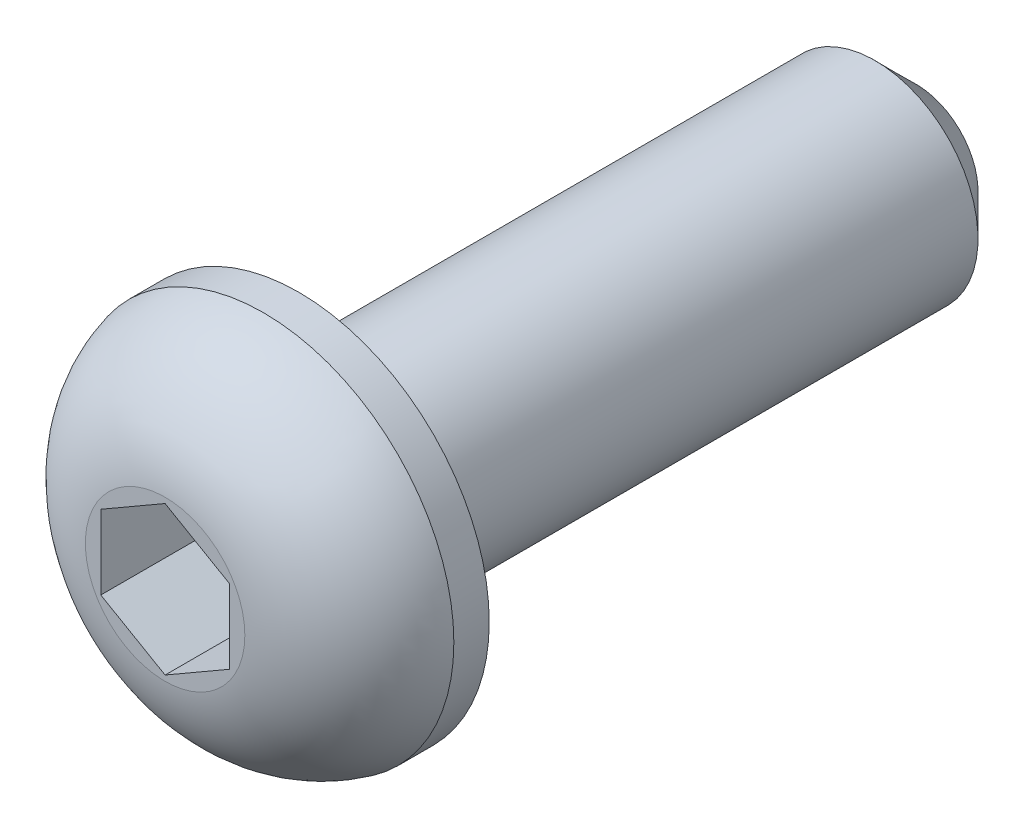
ISO-10303-21;
HEADER;
FILE_DESCRIPTION(('STEP AP214'),'2;1');
FILE_NAME('part.step','',(''),(''),'','','');
FILE_SCHEMA(('AUTOMOTIVE_DESIGN { 1 0 10303 214 1 1 1 1 }'));
ENDSEC;
DATA;
#1=APPLICATION_CONTEXT('core data for automotive mechanical design processes');
#2=APPLICATION_PROTOCOL_DEFINITION('international standard','automotive_design',2000,#1);
#3=PRODUCT_CONTEXT('',#1,'mechanical');
#4=PRODUCT('Part','Part','',(#3));
#5=PRODUCT_RELATED_PRODUCT_CATEGORY('part','',(#4));
#6=PRODUCT_DEFINITION_FORMATION('','',#4);
#7=PRODUCT_DEFINITION_CONTEXT('part definition',#1,'design');
#8=PRODUCT_DEFINITION('design','',#6,#7);
#9=PRODUCT_DEFINITION_SHAPE('','',#8);
#10=(LENGTH_UNIT() NAMED_UNIT(*) SI_UNIT(.MILLI.,.METRE.));
#11=(NAMED_UNIT(*) PLANE_ANGLE_UNIT() SI_UNIT($,.RADIAN.));
#12=(NAMED_UNIT(*) SI_UNIT($,.STERADIAN.) SOLID_ANGLE_UNIT());
#13=UNCERTAINTY_MEASURE_WITH_UNIT(LENGTH_MEASURE(1.E-05),#10,'distance_accuracy_value','');
#14=(GEOMETRIC_REPRESENTATION_CONTEXT(3) GLOBAL_UNCERTAINTY_ASSIGNED_CONTEXT((#13)) GLOBAL_UNIT_ASSIGNED_CONTEXT((#10,
#11,#12)) REPRESENTATION_CONTEXT('',''));
#15=CARTESIAN_POINT('',(0.,0.,0.));
#16=DIRECTION('',(0.,0.,1.));
#17=DIRECTION('',(1.,0.,0.));
#18=AXIS2_PLACEMENT_3D('',#15,#16,#17);
#19=CARTESIAN_POINT('',(0.,0.,0.116164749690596));
#20=DIRECTION('',(0.,0.,1.));
#21=DIRECTION('',(1.,0.,0.));
#22=AXIS2_PLACEMENT_3D('',#19,#20,#21);
#23=DEGENERATE_TOROIDAL_SURFACE('',#22,1.26616474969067,2.49999999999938,.T.);
#24=CARTESIAN_POINT('',(0.,0.,2.6));
#25=DIRECTION('',(0.,0.,1.));
#26=DIRECTION('',(1.,0.,0.));
#27=AXIS2_PLACEMENT_3D('',#24,#25,#26);
#28=CIRCLE('',#27,1.54999999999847);
#29=CARTESIAN_POINT('',(1.54999999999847,0.,2.6));
#30=VERTEX_POINT('',#29);
#31=EDGE_CURVE('E118',#30,#30,#28,.T.);
#32=ORIENTED_EDGE('',*,*,#31,.F.);
#33=EDGE_LOOP('',(#32));
#34=FACE_BOUND('',#33,.T.);
#35=CARTESIAN_POINT('',(0.,0.,0.687519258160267));
#36=DIRECTION('',(0.,0.,-1.));
#37=DIRECTION('',(-1.,0.,0.));
#38=AXIS2_PLACEMENT_3D('',#35,#36,#37);
#39=CIRCLE('',#38,3.7);
#40=CARTESIAN_POINT('',(-3.7,0.,0.687519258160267));
#41=VERTEX_POINT('',#40);
#42=EDGE_CURVE('E188',#41,#41,#39,.T.);
#43=ORIENTED_EDGE('',*,*,#42,.F.);
#44=EDGE_LOOP('',(#43));
#45=FACE_BOUND('',#44,.T.);
#46=ADVANCED_FACE('F14',(#34,#45),#23,.T.);
#47=CARTESIAN_POINT('',(0.,1.54999999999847,2.6));
#48=DIRECTION('',(0.,0.,-1.));
#49=DIRECTION('',(-1.,0.,0.));
#50=AXIS2_PLACEMENT_3D('',#47,#48,#49);
#51=PLANE('',#50);
#52=DIRECTION('',(-0.866025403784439,-0.5,0.));
#53=VECTOR('',#52,1.);
#54=CARTESIAN_POINT('',(0.,1.44337567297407,2.6));
#55=LINE('',#54,#53);
#56=CARTESIAN_POINT('',(0.,1.44337567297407,2.6));
#57=VERTEX_POINT('',#56);
#58=CARTESIAN_POINT('',(-1.25,0.721687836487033,2.6));
#59=VERTEX_POINT('',#58);
#60=EDGE_CURVE('E104',#57,#59,#55,.T.);
#61=ORIENTED_EDGE('',*,*,#60,.F.);
#62=DIRECTION('',(-0.866025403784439,0.5,0.));
#63=VECTOR('',#62,1.);
#64=CARTESIAN_POINT('',(1.25,0.721687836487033,2.6));
#65=LINE('',#64,#63);
#66=CARTESIAN_POINT('',(1.25,0.721687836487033,2.6));
#67=VERTEX_POINT('',#66);
#68=EDGE_CURVE('E30',#67,#57,#65,.T.);
#69=ORIENTED_EDGE('',*,*,#68,.F.);
#70=DIRECTION('',(0.,1.,0.));
#71=VECTOR('',#70,1.);
#72=CARTESIAN_POINT('',(1.25,-0.721687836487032,2.6));
#73=LINE('',#72,#71);
#74=CARTESIAN_POINT('',(1.25,-0.721687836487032,2.6));
#75=VERTEX_POINT('',#74);
#76=EDGE_CURVE('E114',#75,#67,#73,.T.);
#77=ORIENTED_EDGE('',*,*,#76,.F.);
#78=DIRECTION('',(0.866025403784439,0.5,0.));
#79=VECTOR('',#78,1.);
#80=CARTESIAN_POINT('',(0.,-1.44337567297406,2.6));
#81=LINE('',#80,#79);
#82=CARTESIAN_POINT('',(0.,-1.44337567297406,2.6));
#83=VERTEX_POINT('',#82);
#84=EDGE_CURVE('E112',#83,#75,#81,.T.);
#85=ORIENTED_EDGE('',*,*,#84,.F.);
#86=DIRECTION('',(0.866025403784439,-0.5,0.));
#87=VECTOR('',#86,1.);
#88=CARTESIAN_POINT('',(-1.25,-0.721687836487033,2.6));
#89=LINE('',#88,#87);
#90=CARTESIAN_POINT('',(-1.25,-0.721687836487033,2.6));
#91=VERTEX_POINT('',#90);
#92=EDGE_CURVE('E78',#91,#83,#89,.T.);
#93=ORIENTED_EDGE('',*,*,#92,.F.);
#94=DIRECTION('',(0.,-1.,0.));
#95=VECTOR('',#94,1.);
#96=CARTESIAN_POINT('',(-1.25,0.721687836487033,2.6));
#97=LINE('',#96,#95);
#98=EDGE_CURVE('E108',#59,#91,#97,.T.);
#99=ORIENTED_EDGE('',*,*,#98,.F.);
#100=EDGE_LOOP('',(#61,#69,#77,#85,#93,#99));
#101=FACE_BOUND('',#100,.T.);
#102=ORIENTED_EDGE('',*,*,#31,.T.);
#103=EDGE_LOOP('',(#102));
#104=FACE_BOUND('',#103,.T.);
#105=ADVANCED_FACE('F146',(#101,#104),#51,.F.);
#106=CARTESIAN_POINT('',(1.25,0.721687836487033,0.600000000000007));
#107=DIRECTION('',(0.5,0.866025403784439,0.));
#108=DIRECTION('',(-0.866025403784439,0.5,0.));
#109=AXIS2_PLACEMENT_3D('',#106,#107,#108);
#110=PLANE('',#109);
#111=ORIENTED_EDGE('',*,*,#68,.T.);
#112=DIRECTION('',(0.,0.,1.));
#113=VECTOR('',#112,1.);
#114=CARTESIAN_POINT('',(0.,1.44337567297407,0.600000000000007));
#115=LINE('',#114,#113);
#116=CARTESIAN_POINT('',(0.,1.44337567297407,0.600000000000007));
#117=VERTEX_POINT('',#116);
#118=EDGE_CURVE('E60',#117,#57,#115,.T.);
#119=ORIENTED_EDGE('',*,*,#118,.F.);
#120=DIRECTION('',(-0.866025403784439,0.5,0.));
#121=VECTOR('',#120,1.);
#122=CARTESIAN_POINT('',(1.25,0.721687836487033,0.600000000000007));
#123=LINE('',#122,#121);
#124=CARTESIAN_POINT('',(1.25,0.721687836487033,0.600000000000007));
#125=VERTEX_POINT('',#124);
#126=EDGE_CURVE('E116',#125,#117,#123,.T.);
#127=ORIENTED_EDGE('',*,*,#126,.F.);
#128=DIRECTION('',(0.,0.,1.));
#129=VECTOR('',#128,1.);
#130=CARTESIAN_POINT('',(1.25,0.721687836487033,0.600000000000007));
#131=LINE('',#130,#129);
#132=EDGE_CURVE('E38',#125,#67,#131,.T.);
#133=ORIENTED_EDGE('',*,*,#132,.T.);
#134=EDGE_LOOP('',(#111,#119,#127,#133));
#135=FACE_BOUND('',#134,.T.);
#136=ADVANCED_FACE('F151',(#135),#110,.F.);
#137=CARTESIAN_POINT('',(1.25,-0.721687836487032,0.600000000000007));
#138=DIRECTION('',(1.,0.,0.));
#139=DIRECTION('',(0.,0.,-1.));
#140=AXIS2_PLACEMENT_3D('',#137,#138,#139);
#141=PLANE('',#140);
#142=ORIENTED_EDGE('',*,*,#76,.T.);
#143=ORIENTED_EDGE('',*,*,#132,.F.);
#144=DIRECTION('',(0.,1.,0.));
#145=VECTOR('',#144,1.);
#146=CARTESIAN_POINT('',(1.25,-0.721687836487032,0.600000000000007));
#147=LINE('',#146,#145);
#148=CARTESIAN_POINT('',(1.25,-0.721687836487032,0.600000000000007));
#149=VERTEX_POINT('',#148);
#150=EDGE_CURVE('E90',#149,#125,#147,.T.);
#151=ORIENTED_EDGE('',*,*,#150,.F.);
#152=DIRECTION('',(0.,0.,1.));
#153=VECTOR('',#152,1.);
#154=CARTESIAN_POINT('',(1.25,-0.721687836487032,0.600000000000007));
#155=LINE('',#154,#153);
#156=EDGE_CURVE('E82',#149,#75,#155,.T.);
#157=ORIENTED_EDGE('',*,*,#156,.T.);
#158=EDGE_LOOP('',(#142,#143,#151,#157));
#159=FACE_BOUND('',#158,.T.);
#160=ADVANCED_FACE('F159',(#159),#141,.F.);
#161=CARTESIAN_POINT('',(0.,-1.44337567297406,0.600000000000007));
#162=DIRECTION('',(0.5,-0.866025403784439,0.));
#163=DIRECTION('',(0.866025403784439,0.5,0.));
#164=AXIS2_PLACEMENT_3D('',#161,#162,#163);
#165=PLANE('',#164);
#166=ORIENTED_EDGE('',*,*,#84,.T.);
#167=ORIENTED_EDGE('',*,*,#156,.F.);
#168=DIRECTION('',(0.866025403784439,0.5,0.));
#169=VECTOR('',#168,1.);
#170=CARTESIAN_POINT('',(0.,-1.44337567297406,0.600000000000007));
#171=LINE('',#170,#169);
#172=CARTESIAN_POINT('',(0.,-1.44337567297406,0.600000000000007));
#173=VERTEX_POINT('',#172);
#174=EDGE_CURVE('E86',#173,#149,#171,.T.);
#175=ORIENTED_EDGE('',*,*,#174,.F.);
#176=DIRECTION('',(0.,0.,1.));
#177=VECTOR('',#176,1.);
#178=CARTESIAN_POINT('',(0.,-1.44337567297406,0.600000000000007));
#179=LINE('',#178,#177);
#180=EDGE_CURVE('E71',#173,#83,#179,.T.);
#181=ORIENTED_EDGE('',*,*,#180,.T.);
#182=EDGE_LOOP('',(#166,#167,#175,#181));
#183=FACE_BOUND('',#182,.T.);
#184=ADVANCED_FACE('F87',(#183),#165,.F.);
#185=CARTESIAN_POINT('',(-1.25,-0.721687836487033,0.600000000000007));
#186=DIRECTION('',(-0.5,-0.866025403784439,0.));
#187=DIRECTION('',(0.866025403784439,-0.5,0.));
#188=AXIS2_PLACEMENT_3D('',#185,#186,#187);
#189=PLANE('',#188);
#190=ORIENTED_EDGE('',*,*,#92,.T.);
#191=ORIENTED_EDGE('',*,*,#180,.F.);
#192=DIRECTION('',(0.866025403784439,-0.5,0.));
#193=VECTOR('',#192,1.);
#194=CARTESIAN_POINT('',(-1.25,-0.721687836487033,0.600000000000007));
#195=LINE('',#194,#193);
#196=CARTESIAN_POINT('',(-1.25,-0.721687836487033,0.600000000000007));
#197=VERTEX_POINT('',#196);
#198=EDGE_CURVE('E75',#197,#173,#195,.T.);
#199=ORIENTED_EDGE('',*,*,#198,.F.);
#200=DIRECTION('',(0.,0.,1.));
#201=VECTOR('',#200,1.);
#202=CARTESIAN_POINT('',(-1.25,-0.721687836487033,0.600000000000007));
#203=LINE('',#202,#201);
#204=EDGE_CURVE('E83',#197,#91,#203,.T.);
#205=ORIENTED_EDGE('',*,*,#204,.T.);
#206=EDGE_LOOP('',(#190,#191,#199,#205));
#207=FACE_BOUND('',#206,.T.);
#208=ADVANCED_FACE('F73',(#207),#189,.F.);
#209=CARTESIAN_POINT('',(-1.25,0.721687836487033,0.600000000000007));
#210=DIRECTION('',(-1.,0.,0.));
#211=DIRECTION('',(0.,-1.,0.));
#212=AXIS2_PLACEMENT_3D('',#209,#210,#211);
#213=PLANE('',#212);
#214=ORIENTED_EDGE('',*,*,#98,.T.);
#215=ORIENTED_EDGE('',*,*,#204,.F.);
#216=DIRECTION('',(0.,-1.,0.));
#217=VECTOR('',#216,1.);
#218=CARTESIAN_POINT('',(-1.25,0.721687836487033,0.600000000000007));
#219=LINE('',#218,#217);
#220=CARTESIAN_POINT('',(-1.25,0.721687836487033,0.600000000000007));
#221=VERTEX_POINT('',#220);
#222=EDGE_CURVE('E96',#221,#197,#219,.T.);
#223=ORIENTED_EDGE('',*,*,#222,.F.);
#224=DIRECTION('',(0.,0.,1.));
#225=VECTOR('',#224,1.);
#226=CARTESIAN_POINT('',(-1.25,0.721687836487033,0.600000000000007));
#227=LINE('',#226,#225);
#228=EDGE_CURVE('E121',#221,#59,#227,.T.);
#229=ORIENTED_EDGE('',*,*,#228,.T.);
#230=EDGE_LOOP('',(#214,#215,#223,#229));
#231=FACE_BOUND('',#230,.T.);
#232=ADVANCED_FACE('F163',(#231),#213,.F.);
#233=CARTESIAN_POINT('',(0.,1.44337567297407,0.600000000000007));
#234=DIRECTION('',(-0.5,0.866025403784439,0.));
#235=DIRECTION('',(-0.866025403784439,-0.5,0.));
#236=AXIS2_PLACEMENT_3D('',#233,#234,#235);
#237=PLANE('',#236);
#238=ORIENTED_EDGE('',*,*,#60,.T.);
#239=ORIENTED_EDGE('',*,*,#228,.F.);
#240=DIRECTION('',(-0.866025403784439,-0.5,0.));
#241=VECTOR('',#240,1.);
#242=CARTESIAN_POINT('',(0.,1.44337567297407,0.600000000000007));
#243=LINE('',#242,#241);
#244=EDGE_CURVE('E98',#117,#221,#243,.T.);
#245=ORIENTED_EDGE('',*,*,#244,.F.);
#246=ORIENTED_EDGE('',*,*,#118,.T.);
#247=EDGE_LOOP('',(#238,#239,#245,#246));
#248=FACE_BOUND('',#247,.T.);
#249=ADVANCED_FACE('F160',(#248),#237,.F.);
#250=CARTESIAN_POINT('',(0.,1.44337567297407,0.600000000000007));
#251=DIRECTION('',(0.,0.,1.));
#252=DIRECTION('',(1.,0.,0.));
#253=AXIS2_PLACEMENT_3D('',#250,#251,#252);
#254=PLANE('',#253);
#255=ORIENTED_EDGE('',*,*,#126,.T.);
#256=ORIENTED_EDGE('',*,*,#244,.T.);
#257=ORIENTED_EDGE('',*,*,#222,.T.);
#258=ORIENTED_EDGE('',*,*,#198,.T.);
#259=ORIENTED_EDGE('',*,*,#174,.T.);
#260=ORIENTED_EDGE('',*,*,#150,.T.);
#261=EDGE_LOOP('',(#255,#256,#257,#258,#259,#260));
#262=FACE_BOUND('',#261,.T.);
#263=ADVANCED_FACE('F93',(#262),#254,.T.);
#264=CARTESIAN_POINT('',(0.,0.,-1.4));
#265=DIRECTION('',(0.,0.,1.));
#266=DIRECTION('',(1.,0.,0.));
#267=AXIS2_PLACEMENT_3D('',#264,#265,#266);
#268=CYLINDRICAL_SURFACE('',#267,3.7);
#269=CARTESIAN_POINT('',(0.,0.,0.));
#270=DIRECTION('',(0.,0.,-1.));
#271=DIRECTION('',(-1.,0.,0.));
#272=AXIS2_PLACEMENT_3D('',#269,#270,#271);
#273=CIRCLE('',#272,3.7);
#274=CARTESIAN_POINT('',(-3.7,0.,0.));
#275=VERTEX_POINT('',#274);
#276=EDGE_CURVE('E18',#275,#275,#273,.T.);
#277=ORIENTED_EDGE('',*,*,#276,.F.);
#278=EDGE_LOOP('',(#277));
#279=FACE_BOUND('',#278,.T.);
#280=ORIENTED_EDGE('',*,*,#42,.T.);
#281=EDGE_LOOP('',(#280));
#282=FACE_BOUND('',#281,.T.);
#283=ADVANCED_FACE('F142',(#279,#282),#268,.T.);
#284=CARTESIAN_POINT('',(0.,0.,-12.));
#285=DIRECTION('',(0.,0.,-1.));
#286=DIRECTION('',(-1.,0.,0.));
#287=AXIS2_PLACEMENT_3D('',#284,#285,#286);
#288=PLANE('',#287);
#289=CARTESIAN_POINT('',(0.,0.,-12.));
#290=DIRECTION('',(0.,0.,-1.));
#291=DIRECTION('',(-1.,0.,0.));
#292=AXIS2_PLACEMENT_3D('',#289,#290,#291);
#293=CIRCLE('',#292,1.2);
#294=CARTESIAN_POINT('',(-1.2,0.,-12.));
#295=VERTEX_POINT('',#294);
#296=EDGE_CURVE('E23',#295,#295,#293,.T.);
#297=ORIENTED_EDGE('',*,*,#296,.T.);
#298=EDGE_LOOP('',(#297));
#299=FACE_BOUND('',#298,.T.);
#300=ADVANCED_FACE('F129',(#299),#288,.T.);
#301=CARTESIAN_POINT('',(0.,0.,-12.));
#302=DIRECTION('',(0.,0.,1.));
#303=DIRECTION('',(1.,0.,0.));
#304=AXIS2_PLACEMENT_3D('',#301,#302,#303);
#305=CONICAL_SURFACE('',#304,1.2,0.785398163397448);
#306=CARTESIAN_POINT('',(0.,0.,-11.2));
#307=DIRECTION('',(0.,0.,-1.));
#308=DIRECTION('',(-1.,0.,0.));
#309=AXIS2_PLACEMENT_3D('',#306,#307,#308);
#310=CIRCLE('',#309,2.);
#311=CARTESIAN_POINT('',(-2.,0.,-11.2));
#312=VERTEX_POINT('',#311);
#313=EDGE_CURVE('E9',#312,#312,#310,.F.);
#314=ORIENTED_EDGE('',*,*,#313,.F.);
#315=EDGE_LOOP('',(#314));
#316=FACE_BOUND('',#315,.T.);
#317=ORIENTED_EDGE('',*,*,#296,.F.);
#318=EDGE_LOOP('',(#317));
#319=FACE_BOUND('',#318,.T.);
#320=ADVANCED_FACE('F16',(#316,#319),#305,.T.);
#321=CARTESIAN_POINT('',(0.,0.,5.09999999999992));
#322=DIRECTION('',(0.,0.,1.));
#323=DIRECTION('',(1.,0.,0.));
#324=AXIS2_PLACEMENT_3D('',#321,#322,#323);
#325=CYLINDRICAL_SURFACE('',#324,2.);
#326=ORIENTED_EDGE('',*,*,#313,.T.);
#327=EDGE_LOOP('',(#326));
#328=FACE_BOUND('',#327,.T.);
#329=CARTESIAN_POINT('',(0.,0.,0.));
#330=DIRECTION('',(0.,0.,-1.));
#331=DIRECTION('',(-1.,0.,0.));
#332=AXIS2_PLACEMENT_3D('',#329,#330,#331);
#333=CIRCLE('',#332,2.);
#334=CARTESIAN_POINT('',(-2.,0.,0.));
#335=VERTEX_POINT('',#334);
#336=EDGE_CURVE('E105',#335,#335,#333,.F.);
#337=ORIENTED_EDGE('',*,*,#336,.F.);
#338=EDGE_LOOP('',(#337));
#339=FACE_BOUND('',#338,.T.);
#340=ADVANCED_FACE('F132',(#328,#339),#325,.T.);
#341=CARTESIAN_POINT('',(0.,3.75,0.));
#342=DIRECTION('',(0.,0.,-1.));
#343=DIRECTION('',(-1.,0.,0.));
#344=AXIS2_PLACEMENT_3D('',#341,#342,#343);
#345=PLANE('',#344);
#346=ORIENTED_EDGE('',*,*,#336,.T.);
#347=EDGE_LOOP('',(#346));
#348=FACE_BOUND('',#347,.T.);
#349=ORIENTED_EDGE('',*,*,#276,.T.);
#350=EDGE_LOOP('',(#349));
#351=FACE_BOUND('',#350,.T.);
#352=ADVANCED_FACE('F139',(#348,#351),#345,.T.);
#353=CLOSED_SHELL('',(#46,#105,#136,#160,#184,#208,#232,#249,#263,#283,#300,#320,#340,#352));
#354=MANIFOLD_SOLID_BREP('B1',#353);
#355=ADVANCED_BREP_SHAPE_REPRESENTATION('',(#18,#354),#14);
#356=SHAPE_DEFINITION_REPRESENTATION(#9,#355);
ENDSEC;
END-ISO-10303-21;
